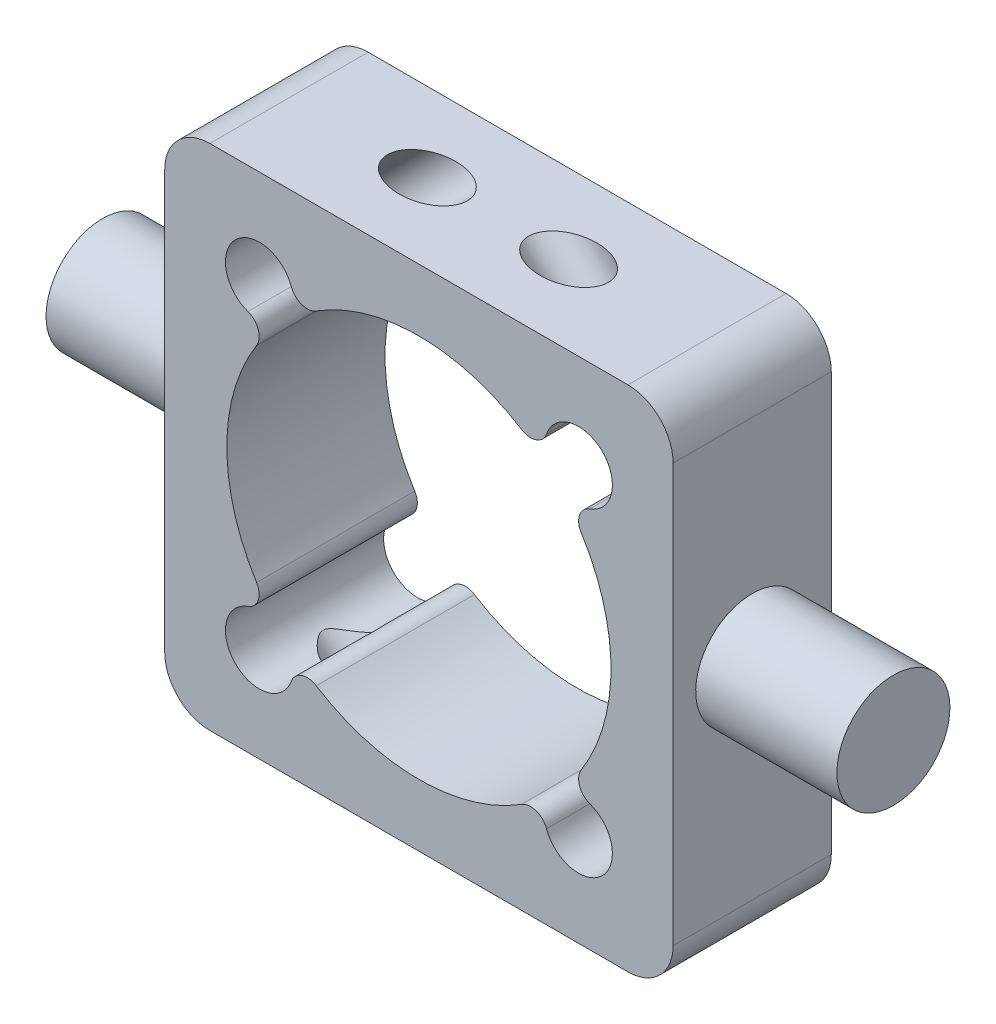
from build123d import *

# Parameters (mm, degrees)
ESBO_O1_W                 = 90
ESBO_O1_H                 = 90
EXTRUS_O1_DEPTH           = 28
ESBO_O2_R                 = 10
EXTRUS_O2_DEPTH           = 25
FILETE2_R                 = 8
ESBO_O6_R                 = 5
EXTRUS_O5_DEPTH           = 30
ESPELHAR3_COPY_1_SKETCH_R = 5
ESPELHAR3_COPY_1_DEPTH    = 30


with BuildPart() as part:
    # Esbo_o1 → Extrus_o1 (new body)
    with BuildSketch(Plane.XY):
        Rectangle(ESBO_O1_W, ESBO_O1_H)
        with BuildLine():
            ThreePointArc((-28.73774064, 18.169817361), (-34, 0), (-28.73774064, -18.169817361))
            ThreePointArc((-28.73774064, -18.169817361), (-28.437438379, -20.751396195), (-30.265615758, -22.598691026))
            ThreePointArc((-30.265615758, -22.598691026), (-32.492640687, -32.492640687), (-22.598691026, -30.265615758))
            ThreePointArc((-22.598691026, -30.265615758), (-20.751396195, -28.437438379), (-18.169817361, -28.73774064))
            ThreePointArc((-18.169817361, -28.73774064), (0, -34), (18.169817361, -28.73774064))
            ThreePointArc((18.169817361, -28.73774064), (20.751396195, -28.437438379), (22.598691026, -30.265615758))
            ThreePointArc((22.598691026, -30.265615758), (32.492640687, -32.492640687), (30.265615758, -22.598691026))
            ThreePointArc((30.265615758, -22.598691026), (28.437438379, -20.751396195), (28.73774064, -18.169817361))
            ThreePointArc((28.73774064, -18.169817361), (34, 0), (28.73774064, 18.169817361))
            ThreePointArc((28.73774064, 18.169817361), (28.437438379, 20.751396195), (30.265615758, 22.598691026))
            ThreePointArc((30.265615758, 22.598691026), (32.492640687, 32.492640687), (22.598691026, 30.265615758))
            ThreePointArc((22.598691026, 30.265615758), (20.751396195, 28.437438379), (18.169817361, 28.73774064))
            ThreePointArc((18.169817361, 28.73774064), (0, 34), (-18.169817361, 28.73774064))
            ThreePointArc((-18.169817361, 28.73774064), (-20.751396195, 28.437438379), (-22.598691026, 30.265615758))
            ThreePointArc((-22.598691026, 30.265615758), (-32.492640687, 32.492640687), (-30.265615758, 22.598691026))
            ThreePointArc((-30.265615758, 22.598691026), (-28.437438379, 20.751396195), (-28.73774064, 18.169817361))
        make_face(mode=Mode.SUBTRACT)
    extrude(amount=EXTRUS_O1_DEPTH)

    # Esbo_o2 → Extrus_o2 (add)
    with BuildSketch(Plane.ZY.offset(45)):
        with Locations(Location((14, 0, 0), (0, 0, 180))):
            Circle(ESBO_O2_R)
    extrus_o2 = extrude(amount=EXTRUS_O2_DEPTH)

    # Espelhar1: Extrus_o2 across plane
    add(extrus_o2.mirror(Plane(origin=(0, 0, 0), x_dir=(0, 0, 1), z_dir=(1, 0, 0))))

    # Filete2
    filete2_edges = [part.edges().sort_by_distance(p)[0] for p in [
        (-45, 45, 14),
        (45, 45, 14),
        (45, -45, 14),
        (-45, -45, 14),
    ]]
    fillet(filete2_edges, radius=FILETE2_R)

    # Esbo_o6 → Extrus_o5 (cut)
    with BuildSketch(Plane(origin=(-20.208168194, 20.208168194, 0), x_dir=(0.7071067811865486, 0.7071067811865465, 0), z_dir=(0.7071067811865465, -0.7071067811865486, 0))):
        with Locations(Location((40.656854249, 14, 0), (0, 0, 180))):
            Circle(ESBO_O6_R)
    extrus_o5 = extrude(amount=EXTRUS_O5_DEPTH, mode=Mode.SUBTRACT)

    # Espelhar2: Extrus_o5 across plane
    add(extrus_o5.mirror(Plane(origin=(0, 0, 0), x_dir=(0, 0, 1), z_dir=(1, 0, 0))), mode=Mode.SUBTRACT)

    # Espelhar3: Extrus_o5 across plane
    add(extrus_o5.mirror(Plane.ZX), mode=Mode.SUBTRACT)

    # Espelhar3 copy 1 sketch → Espelhar3 copy 1 (cut)
    with BuildSketch(Plane(origin=(20.208168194, -20.208168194, 0), x_dir=(-0.707106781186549, -0.707106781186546, 0), z_dir=(-0.707106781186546, 0.707106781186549, 0))):
        with Locations(Location((40.656854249, 14, 0), (0, 0, 180))):
            Circle(ESPELHAR3_COPY_1_SKETCH_R)
    extrude(amount=ESPELHAR3_COPY_1_DEPTH, mode=Mode.SUBTRACT)


solid = part.part
